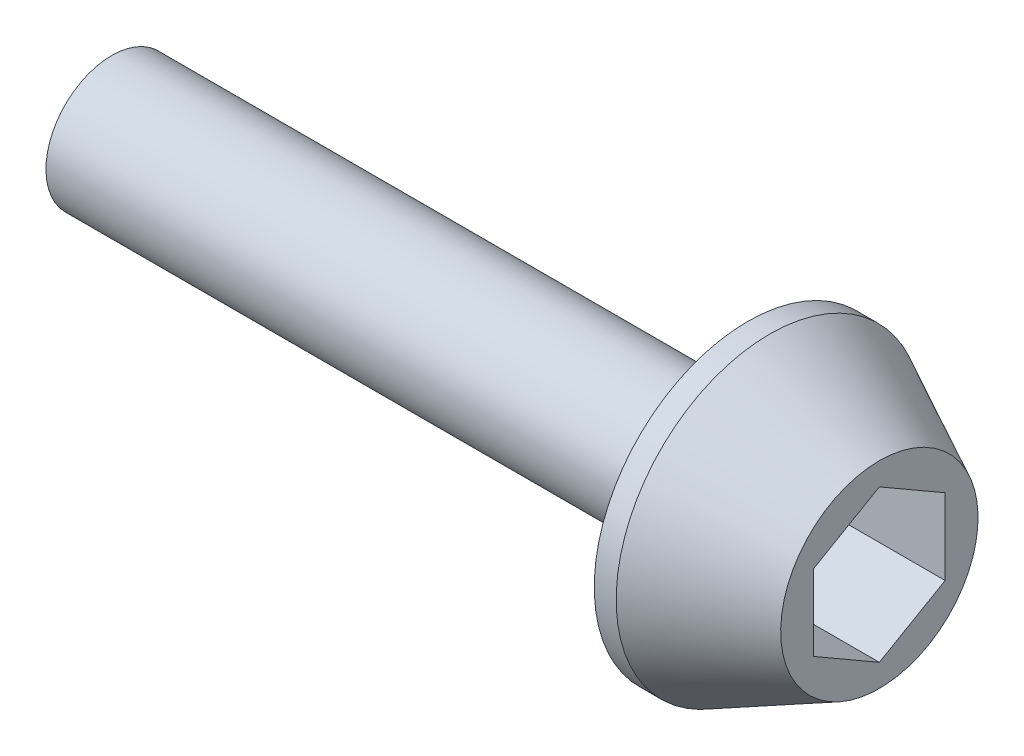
ISO-10303-21;
HEADER;
FILE_DESCRIPTION(('STEP AP214'),'2;1');
FILE_NAME('part.step','',(''),(''),'','','');
FILE_SCHEMA(('AUTOMOTIVE_DESIGN { 1 0 10303 214 1 1 1 1 }'));
ENDSEC;
DATA;
#1=APPLICATION_CONTEXT('core data for automotive mechanical design processes');
#2=APPLICATION_PROTOCOL_DEFINITION('international standard','automotive_design',2000,#1);
#3=PRODUCT_CONTEXT('',#1,'mechanical');
#4=PRODUCT('Part','Part','',(#3));
#5=PRODUCT_RELATED_PRODUCT_CATEGORY('part','',(#4));
#6=PRODUCT_DEFINITION_FORMATION('','',#4);
#7=PRODUCT_DEFINITION_CONTEXT('part definition',#1,'design');
#8=PRODUCT_DEFINITION('design','',#6,#7);
#9=PRODUCT_DEFINITION_SHAPE('','',#8);
#10=(LENGTH_UNIT() NAMED_UNIT(*) SI_UNIT(.MILLI.,.METRE.));
#11=(NAMED_UNIT(*) PLANE_ANGLE_UNIT() SI_UNIT($,.RADIAN.));
#12=(NAMED_UNIT(*) SI_UNIT($,.STERADIAN.) SOLID_ANGLE_UNIT());
#13=UNCERTAINTY_MEASURE_WITH_UNIT(LENGTH_MEASURE(1.E-05),#10,'distance_accuracy_value','');
#14=(GEOMETRIC_REPRESENTATION_CONTEXT(3) GLOBAL_UNCERTAINTY_ASSIGNED_CONTEXT((#13)) GLOBAL_UNIT_ASSIGNED_CONTEXT((#10,
#11,#12)) REPRESENTATION_CONTEXT('',''));
#15=CARTESIAN_POINT('',(0.,0.,0.));
#16=DIRECTION('',(0.,0.,1.));
#17=DIRECTION('',(1.,0.,0.));
#18=AXIS2_PLACEMENT_3D('',#15,#16,#17);
#19=CARTESIAN_POINT('',(-6.,2.,0.));
#20=DIRECTION('',(-1.,0.,0.));
#21=DIRECTION('',(0.,-1.,0.));
#22=AXIS2_PLACEMENT_3D('',#19,#20,#21);
#23=PLANE('',#22);
#24=CARTESIAN_POINT('',(-6.,0.,0.));
#25=DIRECTION('',(1.,0.,0.));
#26=DIRECTION('',(0.,1.,0.));
#27=AXIS2_PLACEMENT_3D('',#24,#25,#26);
#28=CIRCLE('',#27,2.);
#29=CARTESIAN_POINT('',(-6.,2.,0.));
#30=VERTEX_POINT('',#29);
#31=EDGE_CURVE('E133',#30,#30,#28,.T.);
#32=ORIENTED_EDGE('',*,*,#31,.F.);
#33=EDGE_LOOP('',(#32));
#34=FACE_BOUND('',#33,.T.);
#35=ADVANCED_FACE('F32',(#34),#23,.T.);
#36=CARTESIAN_POINT('',(0.,4.5,0.));
#37=DIRECTION('',(1.,0.,0.));
#38=DIRECTION('',(0.,1.,0.));
#39=AXIS2_PLACEMENT_3D('',#36,#37,#38);
#40=PLANE('',#39);
#41=DIRECTION('',(0.,0.5,0.866025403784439));
#42=VECTOR('',#41,1.);
#43=CARTESIAN_POINT('',(0.,1.73205080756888,-3.));
#44=LINE('',#43,#42);
#45=CARTESIAN_POINT('',(0.,1.73205080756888,-3.));
#46=VERTEX_POINT('',#45);
#47=CARTESIAN_POINT('',(0.,3.46410161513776,0.));
#48=VERTEX_POINT('',#47);
#49=EDGE_CURVE('E46',#46,#48,#44,.T.);
#50=ORIENTED_EDGE('',*,*,#49,.F.);
#51=DIRECTION('',(0.,1.,0.));
#52=VECTOR('',#51,1.);
#53=CARTESIAN_POINT('',(0.,-1.73205080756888,-3.));
#54=LINE('',#53,#52);
#55=CARTESIAN_POINT('',(0.,-1.73205080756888,-3.));
#56=VERTEX_POINT('',#55);
#57=EDGE_CURVE('E129',#56,#46,#54,.T.);
#58=ORIENTED_EDGE('',*,*,#57,.F.);
#59=DIRECTION('',(0.,0.5,-0.866025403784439));
#60=VECTOR('',#59,1.);
#61=CARTESIAN_POINT('',(0.,-3.46410161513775,0.));
#62=LINE('',#61,#60);
#63=CARTESIAN_POINT('',(0.,-3.46410161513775,0.));
#64=VERTEX_POINT('',#63);
#65=EDGE_CURVE('E127',#64,#56,#62,.T.);
#66=ORIENTED_EDGE('',*,*,#65,.F.);
#67=DIRECTION('',(0.,-0.5,-0.866025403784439));
#68=VECTOR('',#67,1.);
#69=CARTESIAN_POINT('',(0.,-1.73205080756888,3.));
#70=LINE('',#69,#68);
#71=CARTESIAN_POINT('',(0.,-1.73205080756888,3.));
#72=VERTEX_POINT('',#71);
#73=EDGE_CURVE('E94',#72,#64,#70,.T.);
#74=ORIENTED_EDGE('',*,*,#73,.F.);
#75=DIRECTION('',(0.,-1.,0.));
#76=VECTOR('',#75,1.);
#77=CARTESIAN_POINT('',(0.,1.73205080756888,3.));
#78=LINE('',#77,#76);
#79=CARTESIAN_POINT('',(0.,1.73205080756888,3.));
#80=VERTEX_POINT('',#79);
#81=EDGE_CURVE('E123',#80,#72,#78,.T.);
#82=ORIENTED_EDGE('',*,*,#81,.F.);
#83=DIRECTION('',(0.,-0.5,0.866025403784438));
#84=VECTOR('',#83,1.);
#85=CARTESIAN_POINT('',(0.,3.46410161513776,0.));
#86=LINE('',#85,#84);
#87=EDGE_CURVE('E120',#48,#80,#86,.T.);
#88=ORIENTED_EDGE('',*,*,#87,.F.);
#89=EDGE_LOOP('',(#50,#58,#66,#74,#82,#88));
#90=FACE_BOUND('',#89,.T.);
#91=CARTESIAN_POINT('',(0.,0.,0.));
#92=DIRECTION('',(1.,0.,0.));
#93=DIRECTION('',(0.,1.,0.));
#94=AXIS2_PLACEMENT_3D('',#91,#92,#93);
#95=CIRCLE('',#94,4.5);
#96=CARTESIAN_POINT('',(0.,4.5,0.));
#97=VERTEX_POINT('',#96);
#98=EDGE_CURVE('E11',#97,#97,#95,.T.);
#99=ORIENTED_EDGE('',*,*,#98,.T.);
#100=EDGE_LOOP('',(#99));
#101=FACE_BOUND('',#100,.T.);
#102=ADVANCED_FACE('F170',(#90,#101),#40,.T.);
#103=CARTESIAN_POINT('',(0.,0.,0.));
#104=DIRECTION('',(-1.,0.,0.));
#105=DIRECTION('',(0.,-1.,0.));
#106=AXIS2_PLACEMENT_3D('',#103,#104,#105);
#107=CONICAL_SURFACE('',#106,4.5,0.463647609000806);
#108=CARTESIAN_POINT('',(-5.,0.,0.));
#109=DIRECTION('',(1.,0.,0.));
#110=DIRECTION('',(0.,1.,0.));
#111=AXIS2_PLACEMENT_3D('',#108,#109,#110);
#112=CIRCLE('',#111,7.);
#113=CARTESIAN_POINT('',(-5.,7.,0.));
#114=VERTEX_POINT('',#113);
#115=EDGE_CURVE('E39',#114,#114,#112,.T.);
#116=ORIENTED_EDGE('',*,*,#115,.T.);
#117=EDGE_LOOP('',(#116));
#118=FACE_BOUND('',#117,.T.);
#119=ORIENTED_EDGE('',*,*,#98,.F.);
#120=EDGE_LOOP('',(#119));
#121=FACE_BOUND('',#120,.T.);
#122=ADVANCED_FACE('F155',(#118,#121),#107,.T.);
#123=CARTESIAN_POINT('',(0.,0.,0.));
#124=DIRECTION('',(1.,0.,0.));
#125=DIRECTION('',(0.,1.,0.));
#126=AXIS2_PLACEMENT_3D('',#123,#124,#125);
#127=CYLINDRICAL_SURFACE('',#126,7.);
#128=CARTESIAN_POINT('',(-6.,0.,0.));
#129=DIRECTION('',(1.,0.,0.));
#130=DIRECTION('',(0.,1.,0.));
#131=AXIS2_PLACEMENT_3D('',#128,#129,#130);
#132=CIRCLE('',#131,7.);
#133=CARTESIAN_POINT('',(-6.,7.,0.));
#134=VERTEX_POINT('',#133);
#135=EDGE_CURVE('E150',#134,#134,#132,.T.);
#136=ORIENTED_EDGE('',*,*,#135,.T.);
#137=EDGE_LOOP('',(#136));
#138=FACE_BOUND('',#137,.T.);
#139=ORIENTED_EDGE('',*,*,#115,.F.);
#140=EDGE_LOOP('',(#139));
#141=FACE_BOUND('',#140,.T.);
#142=ADVANCED_FACE('F158',(#138,#141),#127,.T.);
#143=CARTESIAN_POINT('',(-6.,3.,0.));
#144=DIRECTION('',(-1.,0.,0.));
#145=DIRECTION('',(0.,-1.,0.));
#146=AXIS2_PLACEMENT_3D('',#143,#144,#145);
#147=PLANE('',#146);
#148=CARTESIAN_POINT('',(-6.,0.,0.));
#149=DIRECTION('',(1.,0.,0.));
#150=DIRECTION('',(0.,1.,0.));
#151=AXIS2_PLACEMENT_3D('',#148,#149,#150);
#152=CIRCLE('',#151,3.);
#153=CARTESIAN_POINT('',(-6.,3.,0.));
#154=VERTEX_POINT('',#153);
#155=EDGE_CURVE('E147',#154,#154,#152,.T.);
#156=ORIENTED_EDGE('',*,*,#155,.T.);
#157=EDGE_LOOP('',(#156));
#158=FACE_BOUND('',#157,.T.);
#159=ORIENTED_EDGE('',*,*,#135,.F.);
#160=EDGE_LOOP('',(#159));
#161=FACE_BOUND('',#160,.T.);
#162=ADVANCED_FACE('F160',(#158,#161),#147,.T.);
#163=CARTESIAN_POINT('',(0.,0.,0.));
#164=DIRECTION('',(1.,0.,0.));
#165=DIRECTION('',(0.,1.,0.));
#166=AXIS2_PLACEMENT_3D('',#163,#164,#165);
#167=CYLINDRICAL_SURFACE('',#166,3.);
#168=CARTESIAN_POINT('',(-35.,0.,0.));
#169=DIRECTION('',(1.,0.,0.));
#170=DIRECTION('',(0.,1.,0.));
#171=AXIS2_PLACEMENT_3D('',#168,#169,#170);
#172=CIRCLE('',#171,3.);
#173=CARTESIAN_POINT('',(-35.,3.,0.));
#174=VERTEX_POINT('',#173);
#175=EDGE_CURVE('E144',#174,#174,#172,.T.);
#176=ORIENTED_EDGE('',*,*,#175,.T.);
#177=EDGE_LOOP('',(#176));
#178=FACE_BOUND('',#177,.T.);
#179=ORIENTED_EDGE('',*,*,#155,.F.);
#180=EDGE_LOOP('',(#179));
#181=FACE_BOUND('',#180,.T.);
#182=ADVANCED_FACE('F167',(#178,#181),#167,.T.);
#183=CARTESIAN_POINT('',(-35.,3.,0.));
#184=DIRECTION('',(-1.,0.,0.));
#185=DIRECTION('',(0.,-1.,0.));
#186=AXIS2_PLACEMENT_3D('',#183,#184,#185);
#187=PLANE('',#186);
#188=CARTESIAN_POINT('',(-35.,0.,0.));
#189=DIRECTION('',(1.,0.,0.));
#190=DIRECTION('',(0.,1.,0.));
#191=AXIS2_PLACEMENT_3D('',#188,#189,#190);
#192=CIRCLE('',#191,2.);
#193=CARTESIAN_POINT('',(-35.,2.,0.));
#194=VERTEX_POINT('',#193);
#195=EDGE_CURVE('E141',#194,#194,#192,.T.);
#196=ORIENTED_EDGE('',*,*,#195,.T.);
#197=EDGE_LOOP('',(#196));
#198=FACE_BOUND('',#197,.T.);
#199=ORIENTED_EDGE('',*,*,#175,.F.);
#200=EDGE_LOOP('',(#199));
#201=FACE_BOUND('',#200,.T.);
#202=ADVANCED_FACE('F184',(#198,#201),#187,.T.);
#203=CARTESIAN_POINT('',(0.,0.,0.));
#204=DIRECTION('',(1.,0.,0.));
#205=DIRECTION('',(0.,1.,0.));
#206=AXIS2_PLACEMENT_3D('',#203,#204,#205);
#207=CYLINDRICAL_SURFACE('',#206,2.);
#208=ORIENTED_EDGE('',*,*,#31,.T.);
#209=EDGE_LOOP('',(#208));
#210=FACE_BOUND('',#209,.T.);
#211=ORIENTED_EDGE('',*,*,#195,.F.);
#212=EDGE_LOOP('',(#211));
#213=FACE_BOUND('',#212,.T.);
#214=ADVANCED_FACE('F180',(#210,#213),#207,.F.);
#215=CARTESIAN_POINT('',(-5.,1.73205080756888,-3.));
#216=DIRECTION('',(0.,0.866025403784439,-0.5));
#217=DIRECTION('',(0.,0.5,0.866025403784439));
#218=AXIS2_PLACEMENT_3D('',#215,#216,#217);
#219=PLANE('',#218);
#220=ORIENTED_EDGE('',*,*,#49,.T.);
#221=DIRECTION('',(1.,0.,0.));
#222=VECTOR('',#221,1.);
#223=CARTESIAN_POINT('',(-5.,3.46410161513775,0.));
#224=LINE('',#223,#222);
#225=CARTESIAN_POINT('',(-5.,3.46410161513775,0.));
#226=VERTEX_POINT('',#225);
#227=EDGE_CURVE('E76',#226,#48,#224,.T.);
#228=ORIENTED_EDGE('',*,*,#227,.F.);
#229=DIRECTION('',(0.,0.5,0.866025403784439));
#230=VECTOR('',#229,1.);
#231=CARTESIAN_POINT('',(-5.,1.73205080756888,-3.));
#232=LINE('',#231,#230);
#233=CARTESIAN_POINT('',(-5.,1.73205080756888,-3.));
#234=VERTEX_POINT('',#233);
#235=EDGE_CURVE('E131',#234,#226,#232,.T.);
#236=ORIENTED_EDGE('',*,*,#235,.F.);
#237=DIRECTION('',(1.,0.,0.));
#238=VECTOR('',#237,1.);
#239=CARTESIAN_POINT('',(-5.,1.73205080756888,-3.));
#240=LINE('',#239,#238);
#241=EDGE_CURVE('E54',#234,#46,#240,.T.);
#242=ORIENTED_EDGE('',*,*,#241,.T.);
#243=EDGE_LOOP('',(#220,#228,#236,#242));
#244=FACE_BOUND('',#243,.T.);
#245=ADVANCED_FACE('F183',(#244),#219,.F.);
#246=CARTESIAN_POINT('',(-5.,-1.73205080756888,-3.));
#247=DIRECTION('',(0.,0.,-1.));
#248=DIRECTION('',(0.,1.,0.));
#249=AXIS2_PLACEMENT_3D('',#246,#247,#248);
#250=PLANE('',#249);
#251=ORIENTED_EDGE('',*,*,#57,.T.);
#252=ORIENTED_EDGE('',*,*,#241,.F.);
#253=DIRECTION('',(0.,1.,0.));
#254=VECTOR('',#253,1.);
#255=CARTESIAN_POINT('',(-5.,-1.73205080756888,-3.));
#256=LINE('',#255,#254);
#257=CARTESIAN_POINT('',(-5.,-1.73205080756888,-3.));
#258=VERTEX_POINT('',#257);
#259=EDGE_CURVE('E106',#258,#234,#256,.T.);
#260=ORIENTED_EDGE('',*,*,#259,.F.);
#261=DIRECTION('',(1.,0.,0.));
#262=VECTOR('',#261,1.);
#263=CARTESIAN_POINT('',(-5.,-1.73205080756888,-3.));
#264=LINE('',#263,#262);
#265=EDGE_CURVE('E98',#258,#56,#264,.T.);
#266=ORIENTED_EDGE('',*,*,#265,.T.);
#267=EDGE_LOOP('',(#251,#252,#260,#266));
#268=FACE_BOUND('',#267,.T.);
#269=ADVANCED_FACE('F204',(#268),#250,.F.);
#270=CARTESIAN_POINT('',(-5.,-3.46410161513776,0.));
#271=DIRECTION('',(0.,-0.866025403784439,-0.5));
#272=DIRECTION('',(0.,0.5,-0.866025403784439));
#273=AXIS2_PLACEMENT_3D('',#270,#271,#272);
#274=PLANE('',#273);
#275=ORIENTED_EDGE('',*,*,#65,.T.);
#276=ORIENTED_EDGE('',*,*,#265,.F.);
#277=DIRECTION('',(0.,0.5,-0.866025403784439));
#278=VECTOR('',#277,1.);
#279=CARTESIAN_POINT('',(-5.,-3.46410161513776,0.));
#280=LINE('',#279,#278);
#281=CARTESIAN_POINT('',(-5.,-3.46410161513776,0.));
#282=VERTEX_POINT('',#281);
#283=EDGE_CURVE('E102',#282,#258,#280,.T.);
#284=ORIENTED_EDGE('',*,*,#283,.F.);
#285=DIRECTION('',(1.,0.,0.));
#286=VECTOR('',#285,1.);
#287=CARTESIAN_POINT('',(-5.,-3.46410161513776,0.));
#288=LINE('',#287,#286);
#289=EDGE_CURVE('E87',#282,#64,#288,.T.);
#290=ORIENTED_EDGE('',*,*,#289,.T.);
#291=EDGE_LOOP('',(#275,#276,#284,#290));
#292=FACE_BOUND('',#291,.T.);
#293=ADVANCED_FACE('F103',(#292),#274,.F.);
#294=CARTESIAN_POINT('',(-5.,-1.73205080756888,3.));
#295=DIRECTION('',(0.,-0.866025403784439,0.5));
#296=DIRECTION('',(0.,-0.5,-0.866025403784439));
#297=AXIS2_PLACEMENT_3D('',#294,#295,#296);
#298=PLANE('',#297);
#299=ORIENTED_EDGE('',*,*,#73,.T.);
#300=ORIENTED_EDGE('',*,*,#289,.F.);
#301=DIRECTION('',(0.,-0.5,-0.866025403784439));
#302=VECTOR('',#301,1.);
#303=CARTESIAN_POINT('',(-5.,-1.73205080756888,3.));
#304=LINE('',#303,#302);
#305=CARTESIAN_POINT('',(-5.,-1.73205080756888,3.));
#306=VERTEX_POINT('',#305);
#307=EDGE_CURVE('E91',#306,#282,#304,.T.);
#308=ORIENTED_EDGE('',*,*,#307,.F.);
#309=DIRECTION('',(1.,0.,0.));
#310=VECTOR('',#309,1.);
#311=CARTESIAN_POINT('',(-5.,-1.73205080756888,3.));
#312=LINE('',#311,#310);
#313=EDGE_CURVE('E99',#306,#72,#312,.T.);
#314=ORIENTED_EDGE('',*,*,#313,.T.);
#315=EDGE_LOOP('',(#299,#300,#308,#314));
#316=FACE_BOUND('',#315,.T.);
#317=ADVANCED_FACE('F89',(#316),#298,.F.);
#318=CARTESIAN_POINT('',(-5.,1.73205080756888,3.));
#319=DIRECTION('',(0.,0.,1.));
#320=DIRECTION('',(0.,-1.,0.));
#321=AXIS2_PLACEMENT_3D('',#318,#319,#320);
#322=PLANE('',#321);
#323=ORIENTED_EDGE('',*,*,#81,.T.);
#324=ORIENTED_EDGE('',*,*,#313,.F.);
#325=DIRECTION('',(0.,-1.,0.));
#326=VECTOR('',#325,1.);
#327=CARTESIAN_POINT('',(-5.,1.73205080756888,3.));
#328=LINE('',#327,#326);
#329=CARTESIAN_POINT('',(-5.,1.73205080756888,3.));
#330=VERTEX_POINT('',#329);
#331=EDGE_CURVE('E112',#330,#306,#328,.T.);
#332=ORIENTED_EDGE('',*,*,#331,.F.);
#333=DIRECTION('',(1.,0.,0.));
#334=VECTOR('',#333,1.);
#335=CARTESIAN_POINT('',(-5.,1.73205080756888,3.));
#336=LINE('',#335,#334);
#337=EDGE_CURVE('E136',#330,#80,#336,.T.);
#338=ORIENTED_EDGE('',*,*,#337,.T.);
#339=EDGE_LOOP('',(#323,#324,#332,#338));
#340=FACE_BOUND('',#339,.T.);
#341=ADVANCED_FACE('F208',(#340),#322,.F.);
#342=CARTESIAN_POINT('',(-5.,3.46410161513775,0.));
#343=DIRECTION('',(0.,0.866025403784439,0.5));
#344=DIRECTION('',(0.,-0.5,0.866025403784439));
#345=AXIS2_PLACEMENT_3D('',#342,#343,#344);
#346=PLANE('',#345);
#347=ORIENTED_EDGE('',*,*,#87,.T.);
#348=ORIENTED_EDGE('',*,*,#337,.F.);
#349=DIRECTION('',(0.,-0.5,0.866025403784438));
#350=VECTOR('',#349,1.);
#351=CARTESIAN_POINT('',(-5.,3.46410161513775,0.));
#352=LINE('',#351,#350);
#353=EDGE_CURVE('E114',#226,#330,#352,.T.);
#354=ORIENTED_EDGE('',*,*,#353,.F.);
#355=ORIENTED_EDGE('',*,*,#227,.T.);
#356=EDGE_LOOP('',(#347,#348,#354,#355));
#357=FACE_BOUND('',#356,.T.);
#358=ADVANCED_FACE('F205',(#357),#346,.F.);
#359=CARTESIAN_POINT('',(-5.,0.,0.));
#360=DIRECTION('',(1.,0.,0.));
#361=DIRECTION('',(0.,1.,0.));
#362=AXIS2_PLACEMENT_3D('',#359,#360,#361);
#363=PLANE('',#362);
#364=ORIENTED_EDGE('',*,*,#235,.T.);
#365=ORIENTED_EDGE('',*,*,#353,.T.);
#366=ORIENTED_EDGE('',*,*,#331,.T.);
#367=ORIENTED_EDGE('',*,*,#307,.T.);
#368=ORIENTED_EDGE('',*,*,#283,.T.);
#369=ORIENTED_EDGE('',*,*,#259,.T.);
#370=EDGE_LOOP('',(#364,#365,#366,#367,#368,#369));
#371=FACE_BOUND('',#370,.T.);
#372=ADVANCED_FACE('F109',(#371),#363,.T.);
#373=CLOSED_SHELL('',(#35,#102,#122,#142,#162,#182,#202,#214,#245,#269,#293,#317,#341,#358,#372));
#374=MANIFOLD_SOLID_BREP('B2',#373);
#375=ADVANCED_BREP_SHAPE_REPRESENTATION('',(#18,#374),#14);
#376=SHAPE_DEFINITION_REPRESENTATION(#9,#375);
ENDSEC;
END-ISO-10303-21;
